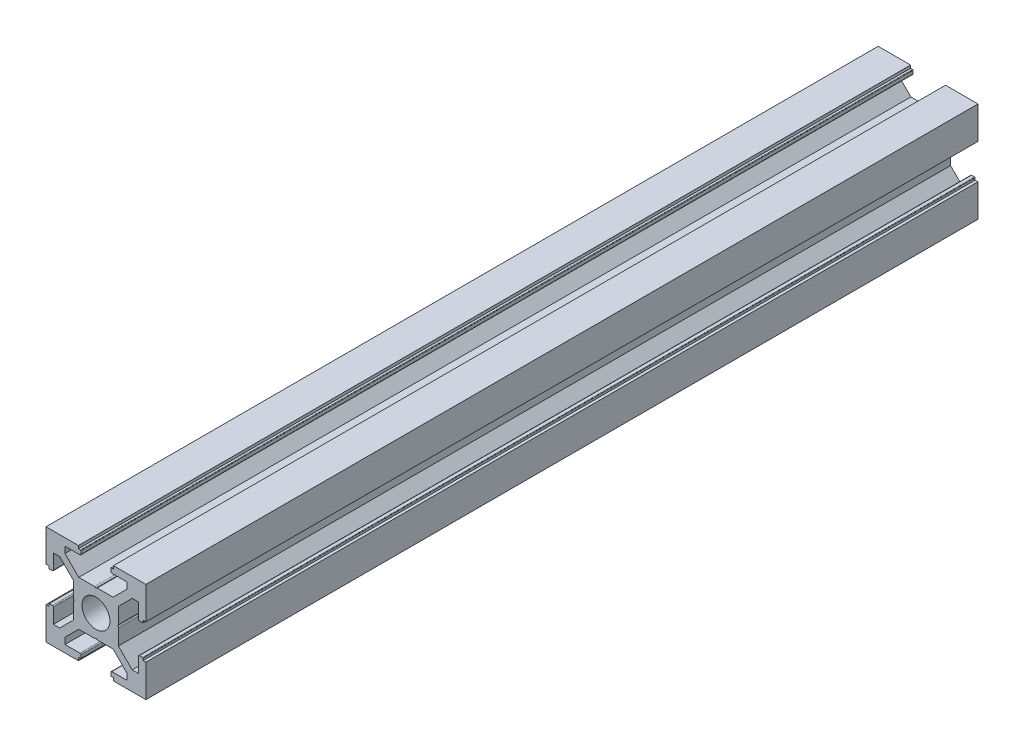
from build123d import *

# Parameters (mm, degrees)
CROQUIS1_R     = 4.2
EXTRUIR1_DEPTH = 250


with BuildPart() as part:
    # Croquis1 → Extruir1 (new body)
    with BuildSketch(Plane.XY):
        with BuildLine():
            Line((-5.25, 15), (-15, 15))
            Line((-15, 15), (-15, 5.25))
            Line((-15, 5.25), (-14.145, 5.25))
            Line((-14.145, 5.25), (-14.145, 4.65))
            ThreePointArc((-14.145, 4.65), (-14.101066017, 4.543933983), (-13.995, 4.5))
            Line((-13.995, 4.5), (-13.095, 4.5))
            ThreePointArc((-13.095, 4.5), (-12.882867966, 4.587867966), (-12.795, 4.8))
            Line((-12.795, 4.8), (-12.795, 9.3))
            Line((-12.795, 9.3), (-10.890990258, 9.3))
            Line((-10.890990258, 9.3), (-8.295495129, 6.704504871))
            Line((-8.295495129, 6.704504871), (-6.75, 5.159009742))
            Line((-6.75, 5.159009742), (-6.75, 0.45))
            ThreePointArc((-6.75, 0.45), (-6.618198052, 0.131801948), (-6.3, 0))
            ThreePointArc((-6.3, 0), (-6.618198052, -0.131801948), (-6.75, -0.45))
            Line((-6.75, -0.45), (-6.75, -5.159009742))
            Line((-6.75, -5.159009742), (-8.295495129, -6.704504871))
            Line((-8.295495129, -6.704504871), (-10.890990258, -9.3))
            Line((-10.890990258, -9.3), (-12.795, -9.3))
            Line((-12.795, -9.3), (-12.795, -4.8))
            ThreePointArc((-12.795, -4.8), (-12.882867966, -4.587867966), (-13.095, -4.5))
            Line((-13.095, -4.5), (-13.995, -4.5))
            ThreePointArc((-13.995, -4.5), (-14.101066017, -4.543933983), (-14.145, -4.65))
            Line((-14.145, -4.65), (-14.145, -5.25))
            Line((-14.145, -5.25), (-15, -5.25))
            Line((-15, -5.25), (-15, -15))
            Line((-15, -15), (-5.25, -15))
            Line((-5.25, -15), (-5.25, -14.145))
            Line((-5.25, -14.145), (-4.65, -14.145))
            ThreePointArc((-4.65, -14.145), (-4.543933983, -14.101066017), (-4.5, -13.995))
            Line((-4.5, -13.995), (-4.5, -13.095))
            ThreePointArc((-4.5, -13.095), (-4.587867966, -12.882867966), (-4.8, -12.795))
            Line((-4.8, -12.795), (-9.3, -12.795))
            Line((-9.3, -12.795), (-9.3, -10.890990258))
            Line((-9.3, -10.890990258), (-6.704504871, -8.295495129))
            Line((-6.704504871, -8.295495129), (-5.159009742, -6.75))
            Line((-5.159009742, -6.75), (-0.45, -6.75))
            ThreePointArc((-0.45, -6.75), (-0.131801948, -6.618198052), (0, -6.3))
            ThreePointArc((0, -6.3), (0.131801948, -6.618198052), (0.45, -6.75))
            Line((0.45, -6.75), (5.159009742, -6.75))
            Line((5.159009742, -6.75), (6.704504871, -8.295495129))
            Line((6.704504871, -8.295495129), (9.3, -10.890990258))
            Line((9.3, -10.890990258), (9.3, -12.795))
            Line((9.3, -12.795), (4.8, -12.795))
            ThreePointArc((4.8, -12.795), (4.587867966, -12.882867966), (4.5, -13.095))
            Line((4.5, -13.095), (4.5, -13.995))
            ThreePointArc((4.5, -13.995), (4.543933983, -14.101066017), (4.65, -14.145))
            Line((4.65, -14.145), (5.25, -14.145))
            Line((5.25, -14.145), (5.25, -15))
            Line((5.25, -15), (15, -15))
            Line((15, -15), (15, -5.25))
            Line((15, -5.25), (14.145, -5.25))
            Line((14.145, -5.25), (14.145, -4.65))
            ThreePointArc((14.145, -4.65), (14.101066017, -4.543933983), (13.995, -4.5))
            Line((13.995, -4.5), (13.095, -4.5))
            ThreePointArc((13.095, -4.5), (12.882867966, -4.587867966), (12.795, -4.8))
            Line((12.795, -4.8), (12.795, -9.3))
            Line((12.795, -9.3), (10.890990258, -9.3))
            Line((10.890990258, -9.3), (8.295495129, -6.704504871))
            Line((8.295495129, -6.704504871), (6.75, -5.159009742))
            Line((6.75, -5.159009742), (6.75, -0.45))
            ThreePointArc((6.75, -0.45), (6.618198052, -0.131801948), (6.3, 0))
            ThreePointArc((6.3, 0), (6.618198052, 0.131801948), (6.75, 0.45))
            Line((6.75, 0.45), (6.75, 5.159009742))
            Line((6.75, 5.159009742), (8.295495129, 6.704504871))
            Line((8.295495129, 6.704504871), (10.890990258, 9.3))
            Line((10.890990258, 9.3), (12.795, 9.3))
            Line((12.795, 9.3), (12.795, 4.8))
            ThreePointArc((12.795, 4.8), (12.882867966, 4.587867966), (13.095, 4.5))
            Line((13.095, 4.5), (13.995, 4.5))
            ThreePointArc((13.995, 4.5), (14.101066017, 4.543933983), (14.145, 4.65))
            Line((14.145, 4.65), (14.145, 5.25))
            Line((14.145, 5.25), (15, 5.25))
            Line((15, 5.25), (15, 15))
            Line((15, 15), (5.25, 15))
            Line((5.25, 15), (5.25, 14.145))
            Line((5.25, 14.145), (4.65, 14.145))
            ThreePointArc((4.65, 14.145), (4.543933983, 14.101066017), (4.5, 13.995))
            Line((4.5, 13.995), (4.5, 13.095))
            ThreePointArc((4.5, 13.095), (4.587867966, 12.882867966), (4.8, 12.795))
            Line((4.8, 12.795), (9.3, 12.795))
            Line((9.3, 12.795), (9.3, 10.890990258))
            Line((9.3, 10.890990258), (6.704504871, 8.295495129))
            Line((6.704504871, 8.295495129), (5.159009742, 6.75))
            Line((5.159009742, 6.75), (0.45, 6.75))
            ThreePointArc((0.45, 6.75), (0.131801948, 6.618198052), (0, 6.3))
            ThreePointArc((0, 6.3), (-0.131801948, 6.618198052), (-0.45, 6.75))
            Line((-0.45, 6.75), (-5.159009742, 6.75))
            Line((-5.159009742, 6.75), (-6.704504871, 8.295495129))
            Line((-6.704504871, 8.295495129), (-9.3, 10.890990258))
            Line((-9.3, 10.890990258), (-9.3, 12.795))
            Line((-9.3, 12.795), (-4.8, 12.795))
            ThreePointArc((-4.8, 12.795), (-4.587867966, 12.882867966), (-4.5, 13.095))
            Line((-4.5, 13.095), (-4.5, 13.995))
            ThreePointArc((-4.5, 13.995), (-4.543933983, 14.101066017), (-4.65, 14.145))
            Line((-4.65, 14.145), (-5.25, 14.145))
            Line((-5.25, 14.145), (-5.25, 15))
        make_face()
        Circle(CROQUIS1_R, mode=Mode.SUBTRACT)
    extrude(amount=EXTRUIR1_DEPTH)


solid = part.part
